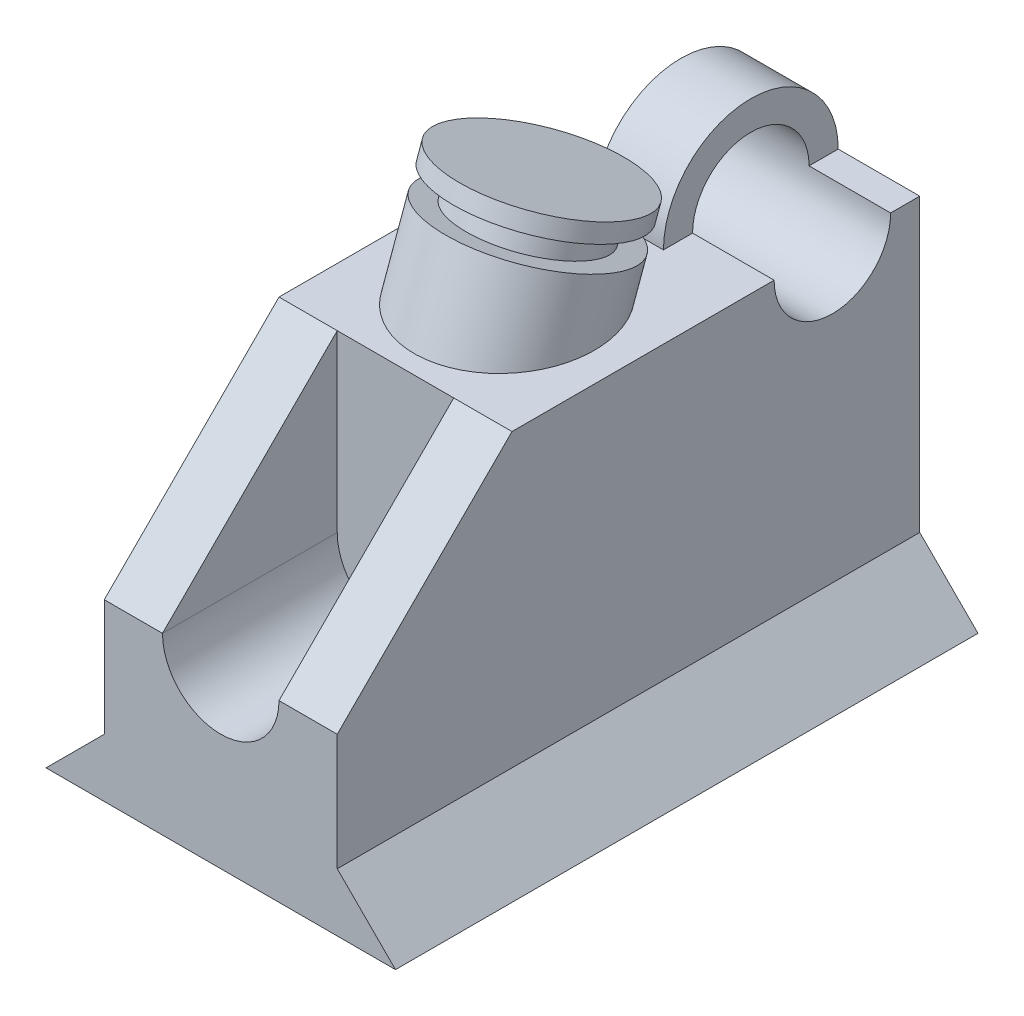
from build123d import *
from build123d.topology import SkipClean

# Parameters (mm, degrees)
BOSS_EXTRUDE1_DEPTH     = 50
CUT_EXTRUDE1_DEPTH      = 93.736184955
CUT_EXTRUDE1_DEPTH_BACK = 93.736184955
CUT_EXTRUDE2_DEPTH      = 30
SKETCH4_R               = 10
CUT_EXTRUDE3_DEPTH      = 93.736184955
BOSS_EXTRUDE2_DEPTH     = 6
BOSS_EXTRUDE3_REACH     = 108.362
SKETCH7_R               = 15


with BuildPart() as part:
    # Sketch1 → Boss-Extrude1 (new, symmetric)
    with BuildSketch(Plane.XY):
        Polygon((-30, 0), (30, 0), (20, 10), (20, 60), (-20, 60), (-20, 10), align=None)
    extrude(amount=BOSS_EXTRUDE1_DEPTH, both=True)

    # Sketch2 → Cut-Extrude1 (cut, two sides: drawn at the far end of the back side and taken through both)
    with BuildSketch(Plane(origin=(20, 0, 0), x_dir=(0, 0, -1), z_dir=(1, 0, 0)).offset(-CUT_EXTRUDE1_DEPTH_BACK)):
        Polygon((-204.719298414, -124.719298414), (-50, 30), (-20, 60), (134.719298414, 214.719298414), (-174.719298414, 524.157895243), (-514.157895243, 184.719298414), align=None)
    extrude(amount=CUT_EXTRUDE1_DEPTH + CUT_EXTRUDE1_DEPTH_BACK, mode=Mode.SUBTRACT)

    # Sketch3 → Cut-Extrude2 (cut)
    with BuildSketch(Plane.XY.offset(50)):
        with BuildLine():
            Line((-10, 30), (-10, 60))
            Line((-10, 60), (10, 60))
            Line((10, 60), (10, 30))
            ThreePointArc((10, 30), (0, 20), (-10, 30))
        make_face()
    extrude(amount=-CUT_EXTRUDE2_DEPTH, mode=Mode.SUBTRACT)

    # Sketch4 → Cut-Extrude3 (cut, through all)
    with BuildSketch(Plane(origin=(20, 0, 0), x_dir=(0, 0, -1), z_dir=(1, 0, 0))):
        with Locations((35, 60)):
            Circle(SKETCH4_R)
    extrude(amount=-CUT_EXTRUDE3_DEPTH, mode=Mode.SUBTRACT)

    # Sketch5 → Boss-Extrude2 (add, symmetric)
    with SkipClean():  # the faces are left unmerged after this step: merging them gives an invalid solid
        with BuildSketch(Plane(origin=(0, 0, 0), x_dir=(0, 0, -1), z_dir=(1, 0, 0))):
            with BuildLine():
                Line((20, 60), (25, 60))
                ThreePointArc((25, 60), (35, 70), (45, 60))
                Line((45, 60), (50, 60))
                ThreePointArc((50, 60), (35, 75), (20, 60))
            make_face()
        extrude(amount=BOSS_EXTRUDE2_DEPTH, both=True)

    # Boss-Extrude3: up to this plane
    with SkipClean():  # the faces are left unmerged after this step: merging them gives an invalid solid
        boss_extrude3_end = Plane(origin=(20, 60, 50), z_dir=(0, -1, 0))
        # Sketch7 → Boss-Extrude3 (add, up to the surface)
        with BuildSketch(Plane(origin=(0, 69.051023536, -25.132517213), x_dir=(1, 0, 0), z_dir=(0, 0.939692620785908, -0.34202014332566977)), mode=Mode.PRIVATE) as boss_extrude3_sk1:
            with Locations(Location((0, -21.315061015, 0), (0, 0, 270))):
                Circle(SKETCH7_R)
        boss_extrude3_tool1 = split(extrude(boss_extrude3_sk1.sketch, amount=-BOSS_EXTRUDE3_REACH, mode=Mode.PRIVATE), bisect_by=boss_extrude3_end, keep=Keep.BOTH, mode=Mode.PRIVATE)
        add(boss_extrude3_tool1.solids().sort_by_distance((0, 76.341204, -5.102912))[0])

    # Sketch8 → Cut-Revolve1 (revolve, cut)
    with SkipClean():  # the faces are left unmerged after this step: merging them gives an invalid solid
        with BuildSketch(Plane(origin=(0, 0, 0), x_dir=(0, 0, -1), z_dir=(1, 0, 0)), mode=Mode.PRIVATE) as cut_revolve1_sk:
            Polygon((-10.018538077, 78.652428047), (-6.494690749, 77.369852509), (-7.862771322, 73.611082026), (-11.38661865, 74.893657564), align=None)
        revolve(cut_revolve1_sk.sketch.rotate(Axis((0, 66.441728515, -1.499797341), (0, 0.9396926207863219, -0.3420201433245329)), 180), axis=Axis((0, 66.441728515, -1.499797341), (0, 0.9396926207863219, -0.3420201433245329)), mode=Mode.SUBTRACT)


solid = part.part
